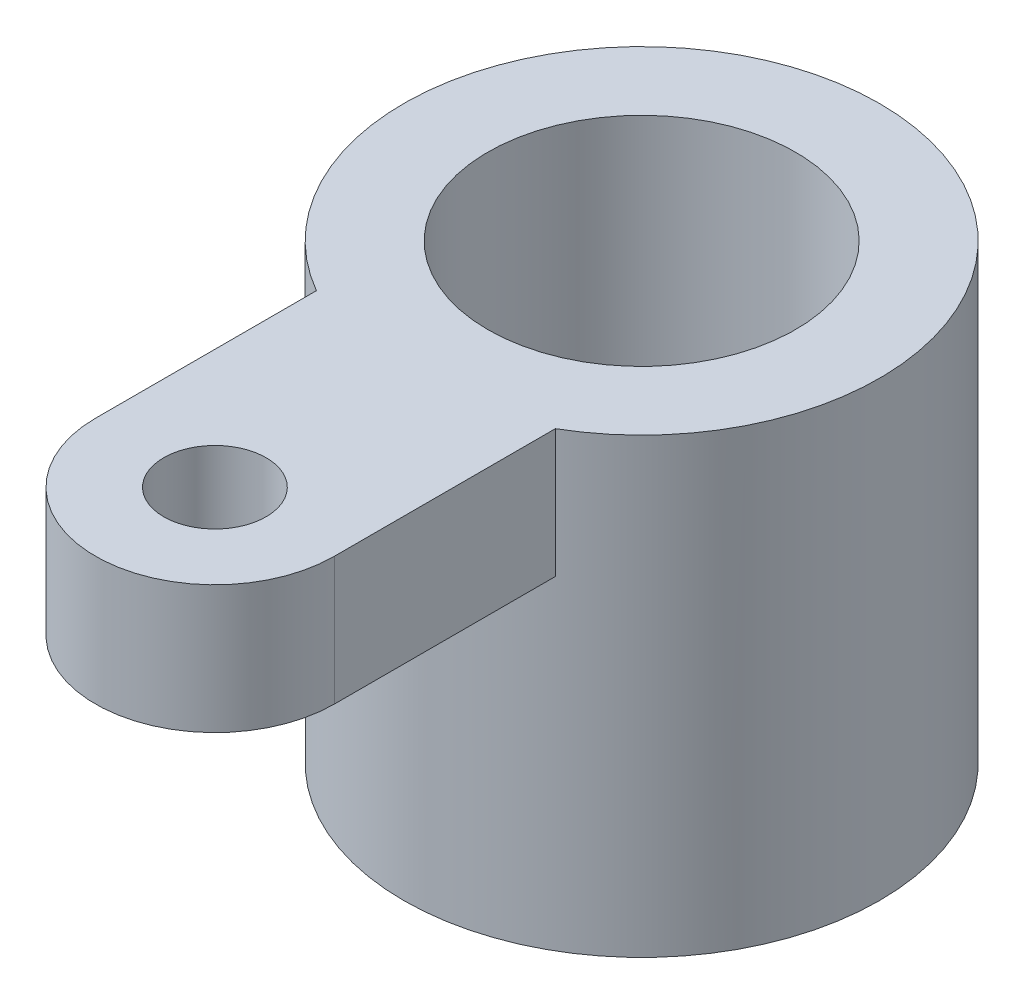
from build123d import *

# Parameters (mm, degrees)
SKETCH_1_R      = 27.880233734
SKETCH_1_R_2    = 18.02305879
EXTRUDE_1_DEPTH = 53
SKETCH_2_R      = 6
EXTRUDE_2_DEPTH = 15


with BuildPart() as part:
    # Sketch 1 → Extrude 1 (new body)
    with BuildSketch(Plane(origin=(0, 0, 0), x_dir=(1, 0, 0), z_dir=(0, 1, 0))):
        with Locations(Location((0, 0, 0), (0, 0, 270))):
            Circle(SKETCH_1_R)
        with Locations(Location((0, 0, 0), (0, 0, 270))):
            Circle(SKETCH_1_R_2, mode=Mode.SUBTRACT)
    extrude(amount=-EXTRUDE_1_DEPTH)

    # Sketch 2 → Extrude 2 (add)
    with BuildSketch(Plane(origin=(0, 0, 0), x_dir=(1, 0, 0), z_dir=(0, 1, 0))):
        with BuildLine():
            Line((-14, -50), (-14, -24.11031798))
            ThreePointArc((-14, -24.11031798), (0, -27.880233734), (14, -24.11031798))
            Line((14, -24.11031798), (14, -50))
            ThreePointArc((14, -50), (0, -64), (-14, -50))
        make_face()
        with Locations(Location((0, -50, 0), (0, 0, 270))):
            Circle(SKETCH_2_R, mode=Mode.SUBTRACT)
    extrude(amount=-EXTRUDE_2_DEPTH)


solid = part.part
